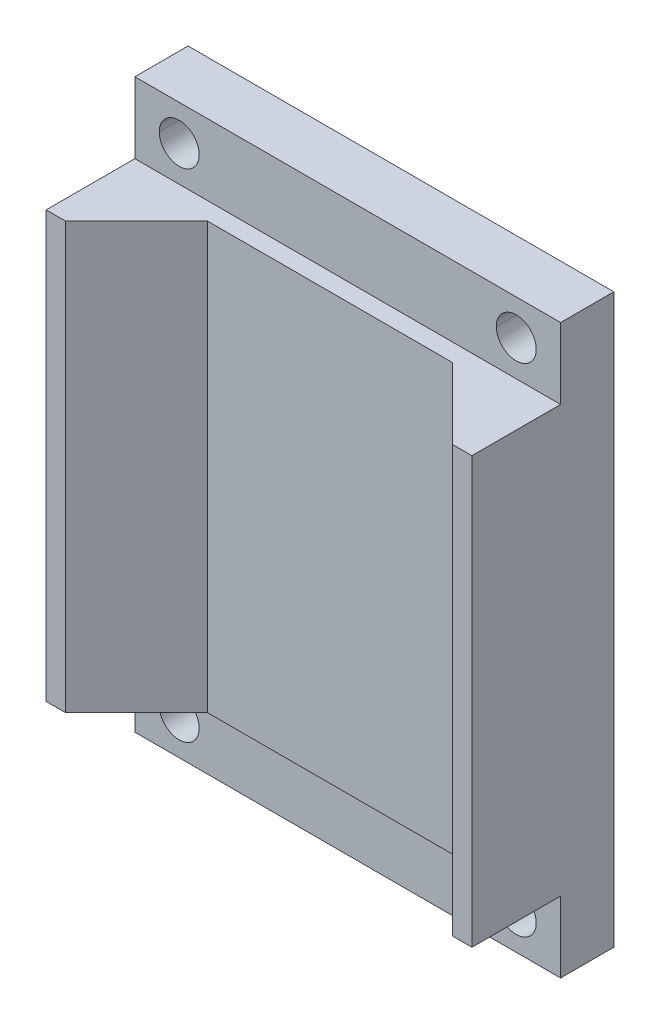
ISO-10303-21;
HEADER;
FILE_DESCRIPTION(('STEP AP214'),'2;1');
FILE_NAME('part.step','',(''),(''),'','','');
FILE_SCHEMA(('AUTOMOTIVE_DESIGN { 1 0 10303 214 1 1 1 1 }'));
ENDSEC;
DATA;
#1=APPLICATION_CONTEXT('core data for automotive mechanical design processes');
#2=APPLICATION_PROTOCOL_DEFINITION('international standard','automotive_design',2000,#1);
#3=PRODUCT_CONTEXT('',#1,'mechanical');
#4=PRODUCT('Part','Part','',(#3));
#5=PRODUCT_RELATED_PRODUCT_CATEGORY('part','',(#4));
#6=PRODUCT_DEFINITION_FORMATION('','',#4);
#7=PRODUCT_DEFINITION_CONTEXT('part definition',#1,'design');
#8=PRODUCT_DEFINITION('design','',#6,#7);
#9=PRODUCT_DEFINITION_SHAPE('','',#8);
#10=(LENGTH_UNIT() NAMED_UNIT(*) SI_UNIT(.MILLI.,.METRE.));
#11=(NAMED_UNIT(*) PLANE_ANGLE_UNIT() SI_UNIT($,.RADIAN.));
#12=(NAMED_UNIT(*) SI_UNIT($,.STERADIAN.) SOLID_ANGLE_UNIT());
#13=UNCERTAINTY_MEASURE_WITH_UNIT(LENGTH_MEASURE(1.E-05),#10,'distance_accuracy_value','');
#14=(GEOMETRIC_REPRESENTATION_CONTEXT(3) GLOBAL_UNCERTAINTY_ASSIGNED_CONTEXT((#13)) GLOBAL_UNIT_ASSIGNED_CONTEXT((#10,
#11,#12)) REPRESENTATION_CONTEXT('',''));
#15=CARTESIAN_POINT('',(0.,0.,0.));
#16=DIRECTION('',(0.,0.,1.));
#17=DIRECTION('',(1.,0.,0.));
#18=AXIS2_PLACEMENT_3D('',#15,#16,#17);
#19=CARTESIAN_POINT('',(-21.9526280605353,-38.1,1.80477854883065E-13));
#20=DIRECTION('',(0.707106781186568,0.,0.707106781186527));
#21=DIRECTION('',(0.707106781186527,0.,-0.707106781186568));
#22=AXIS2_PLACEMENT_3D('',#19,#20,#21);
#23=PLANE('',#22);
#24=DIRECTION('',(0.707106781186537,0.,-0.707106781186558));
#25=VECTOR('',#24,1.);
#26=CARTESIAN_POINT('',(-34.6526280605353,-38.1,12.7000000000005));
#27=LINE('',#26,#25);
#28=CARTESIAN_POINT('',(-34.6526280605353,-38.1,12.7000000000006));
#29=VERTEX_POINT('',#28);
#30=CARTESIAN_POINT('',(-21.9526280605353,-38.1,1.80461201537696E-13));
#31=VERTEX_POINT('',#30);
#32=EDGE_CURVE('E172',#29,#31,#27,.T.);
#33=ORIENTED_EDGE('',*,*,#32,.T.);
#34=DIRECTION('',(0.,1.,0.));
#35=VECTOR('',#34,1.);
#36=CARTESIAN_POINT('',(-21.9526280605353,-38.1,1.80477854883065E-13));
#37=LINE('',#36,#35);
#38=CARTESIAN_POINT('',(-21.9526280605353,38.1,1.87444893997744E-13));
#39=VERTEX_POINT('',#38);
#40=EDGE_CURVE('E156',#39,#31,#37,.F.);
#41=ORIENTED_EDGE('',*,*,#40,.F.);
#42=DIRECTION('',(0.707106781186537,0.,-0.707106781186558));
#43=VECTOR('',#42,1.);
#44=CARTESIAN_POINT('',(-34.6526280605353,38.1,12.7000000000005));
#45=LINE('',#44,#43);
#46=CARTESIAN_POINT('',(-34.6526280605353,38.1,12.7000000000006));
#47=VERTEX_POINT('',#46);
#48=EDGE_CURVE('E282',#47,#39,#45,.T.);
#49=ORIENTED_EDGE('',*,*,#48,.F.);
#50=DIRECTION('',(0.,1.,0.));
#51=VECTOR('',#50,1.);
#52=CARTESIAN_POINT('',(-34.6526280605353,-38.1,12.7000000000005));
#53=LINE('',#52,#51);
#54=EDGE_CURVE('E179',#29,#47,#53,.T.);
#55=ORIENTED_EDGE('',*,*,#54,.F.);
#56=EDGE_LOOP('',(#33,#41,#49,#55));
#57=FACE_BOUND('',#56,.T.);
#58=ADVANCED_FACE('F16',(#57),#23,.T.);
#59=CARTESIAN_POINT('',(21.9526280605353,-38.1,1.80477854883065E-13));
#60=DIRECTION('',(0.,0.,1.));
#61=DIRECTION('',(1.,0.,0.));
#62=AXIS2_PLACEMENT_3D('',#59,#60,#61);
#63=PLANE('',#62);
#64=DIRECTION('',(1.,0.,0.));
#65=VECTOR('',#64,1.);
#66=CARTESIAN_POINT('',(0.,-38.1,1.80411241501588E-13));
#67=LINE('',#66,#65);
#68=CARTESIAN_POINT('',(21.9526280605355,-38.1,0.));
#69=VERTEX_POINT('',#68);
#70=EDGE_CURVE('E160',#31,#69,#67,.T.);
#71=ORIENTED_EDGE('',*,*,#70,.T.);
#72=DIRECTION('',(0.,1.,0.));
#73=VECTOR('',#72,1.);
#74=CARTESIAN_POINT('',(21.9526280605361,-38.1,-5.41233724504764E-13));
#75=LINE('',#74,#73);
#76=CARTESIAN_POINT('',(21.9526280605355,38.1,0.));
#77=VERTEX_POINT('',#76);
#78=EDGE_CURVE('E165',#77,#69,#75,.F.);
#79=ORIENTED_EDGE('',*,*,#78,.F.);
#80=DIRECTION('',(1.,0.,0.));
#81=VECTOR('',#80,1.);
#82=CARTESIAN_POINT('',(0.,38.1,1.80411241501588E-13));
#83=LINE('',#82,#81);
#84=EDGE_CURVE('E161',#39,#77,#83,.T.);
#85=ORIENTED_EDGE('',*,*,#84,.F.);
#86=ORIENTED_EDGE('',*,*,#40,.T.);
#87=EDGE_LOOP('',(#71,#79,#85,#86));
#88=FACE_BOUND('',#87,.T.);
#89=ADVANCED_FACE('F158',(#88),#63,.T.);
#90=CARTESIAN_POINT('',(34.6526280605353,-38.1,12.7000000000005));
#91=DIRECTION('',(-0.707106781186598,0.,0.707106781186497));
#92=DIRECTION('',(0.707106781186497,0.,0.707106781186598));
#93=AXIS2_PLACEMENT_3D('',#90,#91,#92);
#94=PLANE('',#93);
#95=DIRECTION('',(0.707106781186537,0.,0.707106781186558));
#96=VECTOR('',#95,1.);
#97=CARTESIAN_POINT('',(21.9526280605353,-38.1,1.80411241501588E-13));
#98=LINE('',#97,#96);
#99=CARTESIAN_POINT('',(34.6526280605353,-38.1,12.7000000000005));
#100=VERTEX_POINT('',#99);
#101=EDGE_CURVE('E176',#69,#100,#98,.T.);
#102=ORIENTED_EDGE('',*,*,#101,.T.);
#103=DIRECTION('',(0.,1.,0.));
#104=VECTOR('',#103,1.);
#105=CARTESIAN_POINT('',(34.6526280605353,-38.1,12.7000000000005));
#106=LINE('',#105,#104);
#107=CARTESIAN_POINT('',(34.6526280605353,38.1,12.7000000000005));
#108=VERTEX_POINT('',#107);
#109=EDGE_CURVE('E180',#108,#100,#106,.F.);
#110=ORIENTED_EDGE('',*,*,#109,.F.);
#111=DIRECTION('',(0.707106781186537,0.,0.707106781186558));
#112=VECTOR('',#111,1.);
#113=CARTESIAN_POINT('',(21.9526280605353,38.1,1.80411241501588E-13));
#114=LINE('',#113,#112);
#115=EDGE_CURVE('E279',#77,#108,#114,.T.);
#116=ORIENTED_EDGE('',*,*,#115,.F.);
#117=ORIENTED_EDGE('',*,*,#78,.T.);
#118=EDGE_LOOP('',(#102,#110,#116,#117));
#119=FACE_BOUND('',#118,.T.);
#120=ADVANCED_FACE('F294',(#119),#94,.T.);
#121=CARTESIAN_POINT('',(38.1,-38.1,12.7000000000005));
#122=DIRECTION('',(0.,0.,1.));
#123=DIRECTION('',(1.,0.,0.));
#124=AXIS2_PLACEMENT_3D('',#121,#122,#123);
#125=PLANE('',#124);
#126=DIRECTION('',(1.,0.,0.));
#127=VECTOR('',#126,1.);
#128=CARTESIAN_POINT('',(0.,-38.1,12.7000000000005));
#129=LINE('',#128,#127);
#130=CARTESIAN_POINT('',(38.1,-38.1,12.7000000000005));
#131=VERTEX_POINT('',#130);
#132=EDGE_CURVE('E290',#100,#131,#129,.T.);
#133=ORIENTED_EDGE('',*,*,#132,.T.);
#134=DIRECTION('',(0.,1.,0.));
#135=VECTOR('',#134,1.);
#136=CARTESIAN_POINT('',(38.1,50.8,12.7000000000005));
#137=LINE('',#136,#135);
#138=CARTESIAN_POINT('',(38.1,38.1,12.7000000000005));
#139=VERTEX_POINT('',#138);
#140=EDGE_CURVE('E265',#139,#131,#137,.F.);
#141=ORIENTED_EDGE('',*,*,#140,.F.);
#142=DIRECTION('',(1.,0.,0.));
#143=VECTOR('',#142,1.);
#144=CARTESIAN_POINT('',(0.,38.1,12.7000000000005));
#145=LINE('',#144,#143);
#146=EDGE_CURVE('E277',#108,#139,#145,.T.);
#147=ORIENTED_EDGE('',*,*,#146,.F.);
#148=ORIENTED_EDGE('',*,*,#109,.T.);
#149=EDGE_LOOP('',(#133,#141,#147,#148));
#150=FACE_BOUND('',#149,.T.);
#151=ADVANCED_FACE('F321',(#150),#125,.T.);
#152=CARTESIAN_POINT('',(0.,-38.1,-7.93750000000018));
#153=DIRECTION('',(0.,1.,0.));
#154=DIRECTION('',(0.,0.,1.));
#155=AXIS2_PLACEMENT_3D('',#152,#153,#154);
#156=PLANE('',#155);
#157=DIRECTION('',(0.,0.,1.));
#158=VECTOR('',#157,1.);
#159=CARTESIAN_POINT('',(38.1,-38.1,-12.7000000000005));
#160=LINE('',#159,#158);
#161=CARTESIAN_POINT('',(38.1,-38.1,-3.17500000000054));
#162=VERTEX_POINT('',#161);
#163=EDGE_CURVE('E263',#131,#162,#160,.F.);
#164=ORIENTED_EDGE('',*,*,#163,.F.);
#165=ORIENTED_EDGE('',*,*,#132,.F.);
#166=ORIENTED_EDGE('',*,*,#101,.F.);
#167=ORIENTED_EDGE('',*,*,#70,.F.);
#168=ORIENTED_EDGE('',*,*,#32,.F.);
#169=DIRECTION('',(1.,0.,0.));
#170=VECTOR('',#169,1.);
#171=CARTESIAN_POINT('',(-34.6526280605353,-38.1,12.7000000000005));
#172=LINE('',#171,#170);
#173=CARTESIAN_POINT('',(-38.1,-38.1,12.7000000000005));
#174=VERTEX_POINT('',#173);
#175=EDGE_CURVE('E288',#174,#29,#172,.T.);
#176=ORIENTED_EDGE('',*,*,#175,.F.);
#177=DIRECTION('',(0.,0.,1.));
#178=VECTOR('',#177,1.);
#179=CARTESIAN_POINT('',(-38.1,-38.1,-12.7000000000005));
#180=LINE('',#179,#178);
#181=CARTESIAN_POINT('',(-38.1,-38.1,-3.17500000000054));
#182=VERTEX_POINT('',#181);
#183=EDGE_CURVE('E251',#182,#174,#180,.T.);
#184=ORIENTED_EDGE('',*,*,#183,.F.);
#185=DIRECTION('',(1.,0.,0.));
#186=VECTOR('',#185,1.);
#187=CARTESIAN_POINT('',(-23.8125,-38.1,-3.17500000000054));
#188=LINE('',#187,#186);
#189=EDGE_CURVE('E273',#162,#182,#188,.F.);
#190=ORIENTED_EDGE('',*,*,#189,.F.);
#191=EDGE_LOOP('',(#164,#165,#166,#167,#168,#176,#184,#190));
#192=FACE_BOUND('',#191,.T.);
#193=ADVANCED_FACE('F170',(#192),#156,.F.);
#194=CARTESIAN_POINT('',(-34.6526280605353,-38.1,12.7000000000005));
#195=DIRECTION('',(0.,0.,1.));
#196=DIRECTION('',(1.,0.,0.));
#197=AXIS2_PLACEMENT_3D('',#194,#195,#196);
#198=PLANE('',#197);
#199=ORIENTED_EDGE('',*,*,#175,.T.);
#200=ORIENTED_EDGE('',*,*,#54,.T.);
#201=DIRECTION('',(1.,0.,0.));
#202=VECTOR('',#201,1.);
#203=CARTESIAN_POINT('',(0.,38.1,12.7000000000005));
#204=LINE('',#203,#202);
#205=CARTESIAN_POINT('',(-38.1,38.1,12.7000000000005));
#206=VERTEX_POINT('',#205);
#207=EDGE_CURVE('E284',#206,#47,#204,.T.);
#208=ORIENTED_EDGE('',*,*,#207,.F.);
#209=DIRECTION('',(0.,-1.,0.));
#210=VECTOR('',#209,1.);
#211=CARTESIAN_POINT('',(-38.1,-50.8,12.7000000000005));
#212=LINE('',#211,#210);
#213=EDGE_CURVE('E249',#174,#206,#212,.F.);
#214=ORIENTED_EDGE('',*,*,#213,.F.);
#215=EDGE_LOOP('',(#199,#200,#208,#214));
#216=FACE_BOUND('',#215,.T.);
#217=ADVANCED_FACE('F305',(#216),#198,.T.);
#218=CARTESIAN_POINT('',(0.,38.1,-7.93750000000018));
#219=DIRECTION('',(0.,1.,0.));
#220=DIRECTION('',(0.,0.,1.));
#221=AXIS2_PLACEMENT_3D('',#218,#219,#220);
#222=PLANE('',#221);
#223=ORIENTED_EDGE('',*,*,#146,.T.);
#224=DIRECTION('',(0.,0.,1.));
#225=VECTOR('',#224,1.);
#226=CARTESIAN_POINT('',(38.1,38.1,-12.7000000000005));
#227=LINE('',#226,#225);
#228=CARTESIAN_POINT('',(38.1,38.1,-3.17500000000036));
#229=VERTEX_POINT('',#228);
#230=EDGE_CURVE('E267',#229,#139,#227,.T.);
#231=ORIENTED_EDGE('',*,*,#230,.F.);
#232=DIRECTION('',(1.,0.,0.));
#233=VECTOR('',#232,1.);
#234=CARTESIAN_POINT('',(-23.8125,38.1,-3.17500000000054));
#235=LINE('',#234,#233);
#236=CARTESIAN_POINT('',(-38.1,38.1,-3.175));
#237=VERTEX_POINT('',#236);
#238=EDGE_CURVE('E275',#237,#229,#235,.T.);
#239=ORIENTED_EDGE('',*,*,#238,.F.);
#240=DIRECTION('',(0.,0.,1.));
#241=VECTOR('',#240,1.);
#242=CARTESIAN_POINT('',(-38.1,38.1,-12.7000000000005));
#243=LINE('',#242,#241);
#244=EDGE_CURVE('E247',#206,#237,#243,.F.);
#245=ORIENTED_EDGE('',*,*,#244,.F.);
#246=ORIENTED_EDGE('',*,*,#207,.T.);
#247=ORIENTED_EDGE('',*,*,#48,.T.);
#248=ORIENTED_EDGE('',*,*,#84,.T.);
#249=ORIENTED_EDGE('',*,*,#115,.T.);
#250=EDGE_LOOP('',(#223,#231,#239,#245,#246,#247,#248,#249));
#251=FACE_BOUND('',#250,.T.);
#252=ADVANCED_FACE('F298',(#251),#222,.T.);
#253=CARTESIAN_POINT('',(-23.8125,-88.9000000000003,-3.17500000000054));
#254=DIRECTION('',(0.,0.,1.));
#255=DIRECTION('',(1.,0.,0.));
#256=AXIS2_PLACEMENT_3D('',#253,#254,#255);
#257=PLANE('',#256);
#258=DIRECTION('',(1.,0.,0.));
#259=VECTOR('',#258,1.);
#260=CARTESIAN_POINT('',(-38.1,50.8,-3.17500000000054));
#261=LINE('',#260,#259);
#262=CARTESIAN_POINT('',(-38.1,50.8,-3.17500000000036));
#263=VERTEX_POINT('',#262);
#264=CARTESIAN_POINT('',(38.1,50.8,-3.17500000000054));
#265=VERTEX_POINT('',#264);
#266=EDGE_CURVE('E259',#263,#265,#261,.T.);
#267=ORIENTED_EDGE('',*,*,#266,.F.);
#268=DIRECTION('',(0.,-1.,0.));
#269=VECTOR('',#268,1.);
#270=CARTESIAN_POINT('',(-38.1,-50.8,-3.17499999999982));
#271=LINE('',#270,#269);
#272=EDGE_CURVE('E245',#237,#263,#271,.F.);
#273=ORIENTED_EDGE('',*,*,#272,.F.);
#274=ORIENTED_EDGE('',*,*,#238,.T.);
#275=DIRECTION('',(0.,1.,0.));
#276=VECTOR('',#275,1.);
#277=CARTESIAN_POINT('',(38.1,50.8,-3.17500000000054));
#278=LINE('',#277,#276);
#279=EDGE_CURVE('E270',#265,#229,#278,.F.);
#280=ORIENTED_EDGE('',*,*,#279,.F.);
#281=EDGE_LOOP('',(#267,#273,#274,#280));
#282=FACE_BOUND('',#281,.T.);
#283=CARTESIAN_POINT('',(30.1625,44.45,-3.17500000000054));
#284=DIRECTION('',(0.,0.,-1.));
#285=DIRECTION('',(-1.,0.,0.));
#286=AXIS2_PLACEMENT_3D('',#283,#284,#285);
#287=CIRCLE('',#286,3.571875);
#288=CARTESIAN_POINT('',(33.734375,44.45,-3.17500000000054));
#289=VERTEX_POINT('',#288);
#290=CARTESIAN_POINT('',(26.590625,44.45,-3.17500000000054));
#291=VERTEX_POINT('',#290);
#292=EDGE_CURVE('E86',#289,#291,#287,.T.);
#293=ORIENTED_EDGE('',*,*,#292,.T.);
#294=CARTESIAN_POINT('',(30.1625,44.45,-3.17500000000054));
#295=DIRECTION('',(0.,0.,-1.));
#296=DIRECTION('',(-1.,0.,0.));
#297=AXIS2_PLACEMENT_3D('',#294,#295,#296);
#298=CIRCLE('',#297,3.571875);
#299=EDGE_CURVE('E19',#291,#289,#298,.T.);
#300=ORIENTED_EDGE('',*,*,#299,.T.);
#301=EDGE_LOOP('',(#293,#300));
#302=FACE_BOUND('',#301,.T.);
#303=CARTESIAN_POINT('',(-30.1625,44.45,-3.17500000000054));
#304=DIRECTION('',(0.,0.,1.));
#305=DIRECTION('',(1.,0.,0.));
#306=AXIS2_PLACEMENT_3D('',#303,#304,#305);
#307=CIRCLE('',#306,3.571875);
#308=CARTESIAN_POINT('',(-33.734375,44.45,-3.17500000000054));
#309=VERTEX_POINT('',#308);
#310=CARTESIAN_POINT('',(-26.590625,44.45,-3.17500000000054));
#311=VERTEX_POINT('',#310);
#312=EDGE_CURVE('E223',#309,#311,#307,.F.);
#313=ORIENTED_EDGE('',*,*,#312,.T.);
#314=CARTESIAN_POINT('',(-30.1625,44.45,-3.17500000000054));
#315=DIRECTION('',(0.,0.,1.));
#316=DIRECTION('',(1.,0.,0.));
#317=AXIS2_PLACEMENT_3D('',#314,#315,#316);
#318=CIRCLE('',#317,3.571875);
#319=EDGE_CURVE('E227',#311,#309,#318,.F.);
#320=ORIENTED_EDGE('',*,*,#319,.T.);
#321=EDGE_LOOP('',(#313,#320));
#322=FACE_BOUND('',#321,.T.);
#323=ADVANCED_FACE('F381',(#282,#302,#322),#257,.T.);
#324=CARTESIAN_POINT('',(-23.8125,-88.9000000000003,-3.17500000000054));
#325=DIRECTION('',(0.,0.,1.));
#326=DIRECTION('',(1.,0.,0.));
#327=AXIS2_PLACEMENT_3D('',#324,#325,#326);
#328=PLANE('',#327);
#329=ORIENTED_EDGE('',*,*,#189,.T.);
#330=DIRECTION('',(0.,-1.,0.));
#331=VECTOR('',#330,1.);
#332=CARTESIAN_POINT('',(-38.1,-50.8,-3.17500000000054));
#333=LINE('',#332,#331);
#334=CARTESIAN_POINT('',(-38.1,-50.8,-3.17500000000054));
#335=VERTEX_POINT('',#334);
#336=EDGE_CURVE('E253',#335,#182,#333,.F.);
#337=ORIENTED_EDGE('',*,*,#336,.F.);
#338=DIRECTION('',(1.,0.,0.));
#339=VECTOR('',#338,1.);
#340=CARTESIAN_POINT('',(-23.8125,-50.8,-3.17500000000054));
#341=LINE('',#340,#339);
#342=CARTESIAN_POINT('',(38.1,-50.8,-3.17500000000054));
#343=VERTEX_POINT('',#342);
#344=EDGE_CURVE('E94',#343,#335,#341,.F.);
#345=ORIENTED_EDGE('',*,*,#344,.F.);
#346=DIRECTION('',(0.,1.,0.));
#347=VECTOR('',#346,1.);
#348=CARTESIAN_POINT('',(38.1,50.8,-3.17500000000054));
#349=LINE('',#348,#347);
#350=EDGE_CURVE('E261',#162,#343,#349,.F.);
#351=ORIENTED_EDGE('',*,*,#350,.F.);
#352=EDGE_LOOP('',(#329,#337,#345,#351));
#353=FACE_BOUND('',#352,.T.);
#354=CARTESIAN_POINT('',(-30.1625,-44.45,-3.17500000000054));
#355=DIRECTION('',(0.,0.,-1.));
#356=DIRECTION('',(-1.,0.,0.));
#357=AXIS2_PLACEMENT_3D('',#354,#355,#356);
#358=CIRCLE('',#357,3.571875);
#359=CARTESIAN_POINT('',(-33.734375,-44.45,-3.17500000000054));
#360=VERTEX_POINT('',#359);
#361=CARTESIAN_POINT('',(-26.590625,-44.45,-3.17500000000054));
#362=VERTEX_POINT('',#361);
#363=EDGE_CURVE('E207',#360,#362,#358,.T.);
#364=ORIENTED_EDGE('',*,*,#363,.T.);
#365=CARTESIAN_POINT('',(-30.1625,-44.45,-3.17500000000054));
#366=DIRECTION('',(0.,0.,-1.));
#367=DIRECTION('',(-1.,0.,0.));
#368=AXIS2_PLACEMENT_3D('',#365,#366,#367);
#369=CIRCLE('',#368,3.571875);
#370=EDGE_CURVE('E211',#362,#360,#369,.T.);
#371=ORIENTED_EDGE('',*,*,#370,.T.);
#372=EDGE_LOOP('',(#364,#371));
#373=FACE_BOUND('',#372,.T.);
#374=CARTESIAN_POINT('',(30.1625,-44.45,-3.17500000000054));
#375=DIRECTION('',(0.,0.,1.));
#376=DIRECTION('',(1.,0.,0.));
#377=AXIS2_PLACEMENT_3D('',#374,#375,#376);
#378=CIRCLE('',#377,3.571875);
#379=CARTESIAN_POINT('',(33.734375,-44.45,-3.17500000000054));
#380=VERTEX_POINT('',#379);
#381=CARTESIAN_POINT('',(26.590625,-44.45,-3.17500000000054));
#382=VERTEX_POINT('',#381);
#383=EDGE_CURVE('E215',#380,#382,#378,.F.);
#384=ORIENTED_EDGE('',*,*,#383,.T.);
#385=CARTESIAN_POINT('',(30.1625,-44.45,-3.17500000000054));
#386=DIRECTION('',(0.,0.,1.));
#387=DIRECTION('',(1.,0.,0.));
#388=AXIS2_PLACEMENT_3D('',#385,#386,#387);
#389=CIRCLE('',#388,3.571875);
#390=EDGE_CURVE('E219',#382,#380,#389,.F.);
#391=ORIENTED_EDGE('',*,*,#390,.T.);
#392=EDGE_LOOP('',(#384,#391));
#393=FACE_BOUND('',#392,.T.);
#394=ADVANCED_FACE('F314',(#353,#373,#393),#328,.T.);
#395=CARTESIAN_POINT('',(38.1,50.8,-12.7000000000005));
#396=DIRECTION('',(1.,0.,0.));
#397=DIRECTION('',(0.,1.,0.));
#398=AXIS2_PLACEMENT_3D('',#395,#396,#397);
#399=PLANE('',#398);
#400=DIRECTION('',(0.,1.,0.));
#401=VECTOR('',#400,1.);
#402=CARTESIAN_POINT('',(38.1,-34.9250000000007,-12.7000000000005));
#403=LINE('',#402,#401);
#404=CARTESIAN_POINT('',(38.1,-50.8,-12.7000000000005));
#405=VERTEX_POINT('',#404);
#406=CARTESIAN_POINT('',(38.1,50.8,-12.7000000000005));
#407=VERTEX_POINT('',#406);
#408=EDGE_CURVE('E496',#405,#407,#403,.T.);
#409=ORIENTED_EDGE('',*,*,#408,.T.);
#410=DIRECTION('',(0.,0.,1.));
#411=VECTOR('',#410,1.);
#412=CARTESIAN_POINT('',(38.1,50.8,-12.7000000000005));
#413=LINE('',#412,#411);
#414=EDGE_CURVE('E256',#265,#407,#413,.F.);
#415=ORIENTED_EDGE('',*,*,#414,.F.);
#416=ORIENTED_EDGE('',*,*,#279,.T.);
#417=ORIENTED_EDGE('',*,*,#230,.T.);
#418=ORIENTED_EDGE('',*,*,#140,.T.);
#419=ORIENTED_EDGE('',*,*,#163,.T.);
#420=ORIENTED_EDGE('',*,*,#350,.T.);
#421=DIRECTION('',(0.,0.,1.));
#422=VECTOR('',#421,1.);
#423=CARTESIAN_POINT('',(38.1,-50.8,-12.7000000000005));
#424=LINE('',#423,#422);
#425=EDGE_CURVE('E233',#405,#343,#424,.T.);
#426=ORIENTED_EDGE('',*,*,#425,.F.);
#427=EDGE_LOOP('',(#409,#415,#416,#417,#418,#419,#420,#426));
#428=FACE_BOUND('',#427,.T.);
#429=ADVANCED_FACE('F318',(#428),#399,.T.);
#430=CARTESIAN_POINT('',(-38.1,50.8,-12.7000000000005));
#431=DIRECTION('',(0.,1.,0.));
#432=DIRECTION('',(0.,0.,1.));
#433=AXIS2_PLACEMENT_3D('',#430,#431,#432);
#434=PLANE('',#433);
#435=DIRECTION('',(1.,0.,0.));
#436=VECTOR('',#435,1.);
#437=CARTESIAN_POINT('',(0.,50.8,-12.7000000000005));
#438=LINE('',#437,#436);
#439=CARTESIAN_POINT('',(-38.1,50.8,-12.7000000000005));
#440=VERTEX_POINT('',#439);
#441=EDGE_CURVE('E500',#407,#440,#438,.F.);
#442=ORIENTED_EDGE('',*,*,#441,.T.);
#443=DIRECTION('',(0.,0.,1.));
#444=VECTOR('',#443,1.);
#445=CARTESIAN_POINT('',(-38.1,50.8,-12.7000000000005));
#446=LINE('',#445,#444);
#447=EDGE_CURVE('E242',#263,#440,#446,.F.);
#448=ORIENTED_EDGE('',*,*,#447,.F.);
#449=ORIENTED_EDGE('',*,*,#266,.T.);
#450=ORIENTED_EDGE('',*,*,#414,.T.);
#451=EDGE_LOOP('',(#442,#448,#449,#450));
#452=FACE_BOUND('',#451,.T.);
#453=ADVANCED_FACE('F373',(#452),#434,.T.);
#454=CARTESIAN_POINT('',(-38.1,-50.8,-12.7000000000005));
#455=DIRECTION('',(-1.,0.,0.));
#456=DIRECTION('',(0.,-1.,0.));
#457=AXIS2_PLACEMENT_3D('',#454,#455,#456);
#458=PLANE('',#457);
#459=DIRECTION('',(0.,1.,0.));
#460=VECTOR('',#459,1.);
#461=CARTESIAN_POINT('',(-38.1,-34.9250000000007,-12.7000000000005));
#462=LINE('',#461,#460);
#463=CARTESIAN_POINT('',(-38.1,-50.8,-12.7000000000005));
#464=VERTEX_POINT('',#463);
#465=EDGE_CURVE('E503',#440,#464,#462,.F.);
#466=ORIENTED_EDGE('',*,*,#465,.T.);
#467=DIRECTION('',(0.,0.,1.));
#468=VECTOR('',#467,1.);
#469=CARTESIAN_POINT('',(-38.1,-50.8,-12.7000000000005));
#470=LINE('',#469,#468);
#471=EDGE_CURVE('E234',#335,#464,#470,.F.);
#472=ORIENTED_EDGE('',*,*,#471,.F.);
#473=ORIENTED_EDGE('',*,*,#336,.T.);
#474=ORIENTED_EDGE('',*,*,#183,.T.);
#475=ORIENTED_EDGE('',*,*,#213,.T.);
#476=ORIENTED_EDGE('',*,*,#244,.T.);
#477=ORIENTED_EDGE('',*,*,#272,.T.);
#478=ORIENTED_EDGE('',*,*,#447,.T.);
#479=EDGE_LOOP('',(#466,#472,#473,#474,#475,#476,#477,#478));
#480=FACE_BOUND('',#479,.T.);
#481=ADVANCED_FACE('F311',(#480),#458,.T.);
#482=CARTESIAN_POINT('',(-23.8125,-50.8,-12.7000000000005));
#483=DIRECTION('',(0.,-1.,0.));
#484=DIRECTION('',(1.,0.,0.));
#485=AXIS2_PLACEMENT_3D('',#482,#483,#484);
#486=PLANE('',#485);
#487=DIRECTION('',(1.,0.,0.));
#488=VECTOR('',#487,1.);
#489=CARTESIAN_POINT('',(0.,-50.8,-12.7000000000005));
#490=LINE('',#489,#488);
#491=EDGE_CURVE('E206',#464,#405,#490,.T.);
#492=ORIENTED_EDGE('',*,*,#491,.T.);
#493=ORIENTED_EDGE('',*,*,#425,.T.);
#494=ORIENTED_EDGE('',*,*,#344,.T.);
#495=ORIENTED_EDGE('',*,*,#471,.T.);
#496=EDGE_LOOP('',(#492,#493,#494,#495));
#497=FACE_BOUND('',#496,.T.);
#498=ADVANCED_FACE('F368',(#497),#486,.T.);
#499=CARTESIAN_POINT('',(30.1625,44.45,-9.52500000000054));
#500=DIRECTION('',(0.,0.,-1.));
#501=DIRECTION('',(-1.,0.,0.));
#502=AXIS2_PLACEMENT_3D('',#499,#500,#501);
#503=CYLINDRICAL_SURFACE('',#502,3.571875);
#504=ORIENTED_EDGE('',*,*,#299,.F.);
#505=DIRECTION('',(0.,0.,-1.));
#506=VECTOR('',#505,1.);
#507=CARTESIAN_POINT('',(26.590625,44.45,-9.52500000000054));
#508=LINE('',#507,#506);
#509=CARTESIAN_POINT('',(26.590625,44.45,-12.7000000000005));
#510=VERTEX_POINT('',#509);
#511=EDGE_CURVE('E230',#291,#510,#508,.T.);
#512=ORIENTED_EDGE('',*,*,#511,.T.);
#513=CARTESIAN_POINT('',(30.1625,44.45,-12.7000000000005));
#514=DIRECTION('',(0.,0.,-1.));
#515=DIRECTION('',(-1.,0.,0.));
#516=AXIS2_PLACEMENT_3D('',#513,#514,#515);
#517=CIRCLE('',#516,3.571875);
#518=CARTESIAN_POINT('',(33.734375,44.45,-12.7000000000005));
#519=VERTEX_POINT('',#518);
#520=EDGE_CURVE('E203',#510,#519,#517,.T.);
#521=ORIENTED_EDGE('',*,*,#520,.T.);
#522=DIRECTION('',(0.,0.,-1.));
#523=VECTOR('',#522,1.);
#524=CARTESIAN_POINT('',(33.734375,44.45,-9.52500000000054));
#525=LINE('',#524,#523);
#526=EDGE_CURVE('E229',#519,#289,#525,.F.);
#527=ORIENTED_EDGE('',*,*,#526,.T.);
#528=EDGE_LOOP('',(#504,#512,#521,#527));
#529=FACE_BOUND('',#528,.T.);
#530=ADVANCED_FACE('F365',(#529),#503,.F.);
#531=CARTESIAN_POINT('',(30.1625,44.45,-9.52500000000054));
#532=DIRECTION('',(0.,0.,-1.));
#533=DIRECTION('',(-1.,0.,0.));
#534=AXIS2_PLACEMENT_3D('',#531,#532,#533);
#535=CYLINDRICAL_SURFACE('',#534,3.571875);
#536=CARTESIAN_POINT('',(30.1625,44.45,-12.7000000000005));
#537=DIRECTION('',(0.,0.,-1.));
#538=DIRECTION('',(-1.,0.,0.));
#539=AXIS2_PLACEMENT_3D('',#536,#537,#538);
#540=CIRCLE('',#539,3.571875);
#541=EDGE_CURVE('E200',#519,#510,#540,.T.);
#542=ORIENTED_EDGE('',*,*,#541,.T.);
#543=ORIENTED_EDGE('',*,*,#511,.F.);
#544=ORIENTED_EDGE('',*,*,#292,.F.);
#545=ORIENTED_EDGE('',*,*,#526,.F.);
#546=EDGE_LOOP('',(#542,#543,#544,#545));
#547=FACE_BOUND('',#546,.T.);
#548=ADVANCED_FACE('F361',(#547),#535,.F.);
#549=CARTESIAN_POINT('',(-30.1625,44.45,-9.52500000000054));
#550=DIRECTION('',(0.,0.,1.));
#551=DIRECTION('',(1.,0.,0.));
#552=AXIS2_PLACEMENT_3D('',#549,#550,#551);
#553=CYLINDRICAL_SURFACE('',#552,3.571875);
#554=ORIENTED_EDGE('',*,*,#319,.F.);
#555=DIRECTION('',(0.,0.,1.));
#556=VECTOR('',#555,1.);
#557=CARTESIAN_POINT('',(-26.590625,44.45,-9.52500000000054));
#558=LINE('',#557,#556);
#559=CARTESIAN_POINT('',(-26.590625,44.45,-12.7000000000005));
#560=VERTEX_POINT('',#559);
#561=EDGE_CURVE('E226',#311,#560,#558,.F.);
#562=ORIENTED_EDGE('',*,*,#561,.T.);
#563=CARTESIAN_POINT('',(-30.1625,44.45,-12.7000000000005));
#564=DIRECTION('',(0.,0.,1.));
#565=DIRECTION('',(1.,0.,0.));
#566=AXIS2_PLACEMENT_3D('',#563,#564,#565);
#567=CIRCLE('',#566,3.571875);
#568=CARTESIAN_POINT('',(-33.734375,44.45,-12.7000000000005));
#569=VERTEX_POINT('',#568);
#570=EDGE_CURVE('E197',#560,#569,#567,.F.);
#571=ORIENTED_EDGE('',*,*,#570,.T.);
#572=DIRECTION('',(0.,0.,1.));
#573=VECTOR('',#572,1.);
#574=CARTESIAN_POINT('',(-33.734375,44.45,-9.52500000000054));
#575=LINE('',#574,#573);
#576=EDGE_CURVE('E222',#569,#309,#575,.T.);
#577=ORIENTED_EDGE('',*,*,#576,.T.);
#578=EDGE_LOOP('',(#554,#562,#571,#577));
#579=FACE_BOUND('',#578,.T.);
#580=ADVANCED_FACE('F357',(#579),#553,.F.);
#581=CARTESIAN_POINT('',(-30.1625,44.45,-9.52500000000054));
#582=DIRECTION('',(0.,0.,1.));
#583=DIRECTION('',(1.,0.,0.));
#584=AXIS2_PLACEMENT_3D('',#581,#582,#583);
#585=CYLINDRICAL_SURFACE('',#584,3.571875);
#586=CARTESIAN_POINT('',(-30.1625,44.45,-12.7000000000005));
#587=DIRECTION('',(0.,0.,1.));
#588=DIRECTION('',(1.,0.,0.));
#589=AXIS2_PLACEMENT_3D('',#586,#587,#588);
#590=CIRCLE('',#589,3.571875);
#591=EDGE_CURVE('E194',#569,#560,#590,.F.);
#592=ORIENTED_EDGE('',*,*,#591,.T.);
#593=ORIENTED_EDGE('',*,*,#561,.F.);
#594=ORIENTED_EDGE('',*,*,#312,.F.);
#595=ORIENTED_EDGE('',*,*,#576,.F.);
#596=EDGE_LOOP('',(#592,#593,#594,#595));
#597=FACE_BOUND('',#596,.T.);
#598=ADVANCED_FACE('F353',(#597),#585,.F.);
#599=CARTESIAN_POINT('',(30.1625,-44.45,-9.52500000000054));
#600=DIRECTION('',(0.,0.,1.));
#601=DIRECTION('',(1.,0.,0.));
#602=AXIS2_PLACEMENT_3D('',#599,#600,#601);
#603=CYLINDRICAL_SURFACE('',#602,3.571875);
#604=ORIENTED_EDGE('',*,*,#390,.F.);
#605=DIRECTION('',(0.,0.,1.));
#606=VECTOR('',#605,1.);
#607=CARTESIAN_POINT('',(26.590625,-44.45,-9.52500000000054));
#608=LINE('',#607,#606);
#609=CARTESIAN_POINT('',(26.590625,-44.45,-12.7000000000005));
#610=VERTEX_POINT('',#609);
#611=EDGE_CURVE('E218',#382,#610,#608,.F.);
#612=ORIENTED_EDGE('',*,*,#611,.T.);
#613=CARTESIAN_POINT('',(30.1625,-44.45,-12.7000000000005));
#614=DIRECTION('',(0.,0.,1.));
#615=DIRECTION('',(1.,0.,0.));
#616=AXIS2_PLACEMENT_3D('',#613,#614,#615);
#617=CIRCLE('',#616,3.571875);
#618=CARTESIAN_POINT('',(33.734375,-44.45,-12.7000000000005));
#619=VERTEX_POINT('',#618);
#620=EDGE_CURVE('E191',#610,#619,#617,.F.);
#621=ORIENTED_EDGE('',*,*,#620,.T.);
#622=DIRECTION('',(0.,0.,1.));
#623=VECTOR('',#622,1.);
#624=CARTESIAN_POINT('',(33.734375,-44.45,-9.52500000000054));
#625=LINE('',#624,#623);
#626=EDGE_CURVE('E214',#619,#380,#625,.T.);
#627=ORIENTED_EDGE('',*,*,#626,.T.);
#628=EDGE_LOOP('',(#604,#612,#621,#627));
#629=FACE_BOUND('',#628,.T.);
#630=ADVANCED_FACE('F349',(#629),#603,.F.);
#631=CARTESIAN_POINT('',(30.1625,-44.45,-9.52500000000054));
#632=DIRECTION('',(0.,0.,1.));
#633=DIRECTION('',(1.,0.,0.));
#634=AXIS2_PLACEMENT_3D('',#631,#632,#633);
#635=CYLINDRICAL_SURFACE('',#634,3.571875);
#636=CARTESIAN_POINT('',(30.1625,-44.45,-12.7000000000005));
#637=DIRECTION('',(0.,0.,1.));
#638=DIRECTION('',(1.,0.,0.));
#639=AXIS2_PLACEMENT_3D('',#636,#637,#638);
#640=CIRCLE('',#639,3.571875);
#641=EDGE_CURVE('E188',#619,#610,#640,.F.);
#642=ORIENTED_EDGE('',*,*,#641,.T.);
#643=ORIENTED_EDGE('',*,*,#611,.F.);
#644=ORIENTED_EDGE('',*,*,#383,.F.);
#645=ORIENTED_EDGE('',*,*,#626,.F.);
#646=EDGE_LOOP('',(#642,#643,#644,#645));
#647=FACE_BOUND('',#646,.T.);
#648=ADVANCED_FACE('F345',(#647),#635,.F.);
#649=CARTESIAN_POINT('',(-30.1625,-44.45,-9.52500000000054));
#650=DIRECTION('',(0.,0.,-1.));
#651=DIRECTION('',(-1.,0.,0.));
#652=AXIS2_PLACEMENT_3D('',#649,#650,#651);
#653=CYLINDRICAL_SURFACE('',#652,3.571875);
#654=ORIENTED_EDGE('',*,*,#370,.F.);
#655=DIRECTION('',(0.,0.,-1.));
#656=VECTOR('',#655,1.);
#657=CARTESIAN_POINT('',(-26.590625,-44.45,-9.52500000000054));
#658=LINE('',#657,#656);
#659=CARTESIAN_POINT('',(-26.590625,-44.45,-12.7000000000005));
#660=VERTEX_POINT('',#659);
#661=EDGE_CURVE('E210',#362,#660,#658,.T.);
#662=ORIENTED_EDGE('',*,*,#661,.T.);
#663=CARTESIAN_POINT('',(-30.1625,-44.45,-12.7000000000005));
#664=DIRECTION('',(0.,0.,-1.));
#665=DIRECTION('',(-1.,0.,0.));
#666=AXIS2_PLACEMENT_3D('',#663,#664,#665);
#667=CIRCLE('',#666,3.571875);
#668=CARTESIAN_POINT('',(-33.734375,-44.45,-12.7000000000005));
#669=VERTEX_POINT('',#668);
#670=EDGE_CURVE('E25',#660,#669,#667,.T.);
#671=ORIENTED_EDGE('',*,*,#670,.T.);
#672=DIRECTION('',(0.,0.,-1.));
#673=VECTOR('',#672,1.);
#674=CARTESIAN_POINT('',(-33.734375,-44.45,-9.52500000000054));
#675=LINE('',#674,#673);
#676=EDGE_CURVE('E33',#669,#360,#675,.F.);
#677=ORIENTED_EDGE('',*,*,#676,.T.);
#678=EDGE_LOOP('',(#654,#662,#671,#677));
#679=FACE_BOUND('',#678,.T.);
#680=ADVANCED_FACE('F339',(#679),#653,.F.);
#681=CARTESIAN_POINT('',(-30.1625,-44.45,-9.52500000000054));
#682=DIRECTION('',(0.,0.,-1.));
#683=DIRECTION('',(-1.,0.,0.));
#684=AXIS2_PLACEMENT_3D('',#681,#682,#683);
#685=CYLINDRICAL_SURFACE('',#684,3.571875);
#686=CARTESIAN_POINT('',(-30.1625,-44.45,-12.7000000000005));
#687=DIRECTION('',(0.,0.,-1.));
#688=DIRECTION('',(-1.,0.,0.));
#689=AXIS2_PLACEMENT_3D('',#686,#687,#688);
#690=CIRCLE('',#689,3.571875);
#691=EDGE_CURVE('E11',#669,#660,#690,.T.);
#692=ORIENTED_EDGE('',*,*,#691,.T.);
#693=ORIENTED_EDGE('',*,*,#661,.F.);
#694=ORIENTED_EDGE('',*,*,#363,.F.);
#695=ORIENTED_EDGE('',*,*,#676,.F.);
#696=EDGE_LOOP('',(#692,#693,#694,#695));
#697=FACE_BOUND('',#696,.T.);
#698=ADVANCED_FACE('F333',(#697),#685,.F.);
#699=CARTESIAN_POINT('',(0.,-34.9250000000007,-12.7000000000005));
#700=DIRECTION('',(0.,0.,1.));
#701=DIRECTION('',(1.,0.,0.));
#702=AXIS2_PLACEMENT_3D('',#699,#700,#701);
#703=PLANE('',#702);
#704=ORIENTED_EDGE('',*,*,#670,.F.);
#705=ORIENTED_EDGE('',*,*,#691,.F.);
#706=EDGE_LOOP('',(#704,#705));
#707=FACE_BOUND('',#706,.T.);
#708=ORIENTED_EDGE('',*,*,#620,.F.);
#709=ORIENTED_EDGE('',*,*,#641,.F.);
#710=EDGE_LOOP('',(#708,#709));
#711=FACE_BOUND('',#710,.T.);
#712=ORIENTED_EDGE('',*,*,#570,.F.);
#713=ORIENTED_EDGE('',*,*,#591,.F.);
#714=EDGE_LOOP('',(#712,#713));
#715=FACE_BOUND('',#714,.T.);
#716=ORIENTED_EDGE('',*,*,#520,.F.);
#717=ORIENTED_EDGE('',*,*,#541,.F.);
#718=EDGE_LOOP('',(#716,#717));
#719=FACE_BOUND('',#718,.T.);
#720=ORIENTED_EDGE('',*,*,#465,.F.);
#721=ORIENTED_EDGE('',*,*,#441,.F.);
#722=ORIENTED_EDGE('',*,*,#408,.F.);
#723=ORIENTED_EDGE('',*,*,#491,.F.);
#724=EDGE_LOOP('',(#720,#721,#722,#723));
#725=FACE_BOUND('',#724,.T.);
#726=ADVANCED_FACE('F331',(#707,#711,#715,#719,#725),#703,.F.);
#727=CLOSED_SHELL('',(#58,#89,#120,#151,#193,#217,#252,#323,#394,#429,#453,#481,#498,#530,#548,
#580,#598,#630,#648,#680,#698,#726));
#728=MANIFOLD_SOLID_BREP('B1',#727);
#729=ADVANCED_BREP_SHAPE_REPRESENTATION('',(#18,#728),#14);
#730=SHAPE_DEFINITION_REPRESENTATION(#9,#729);
ENDSEC;
END-ISO-10303-21;
